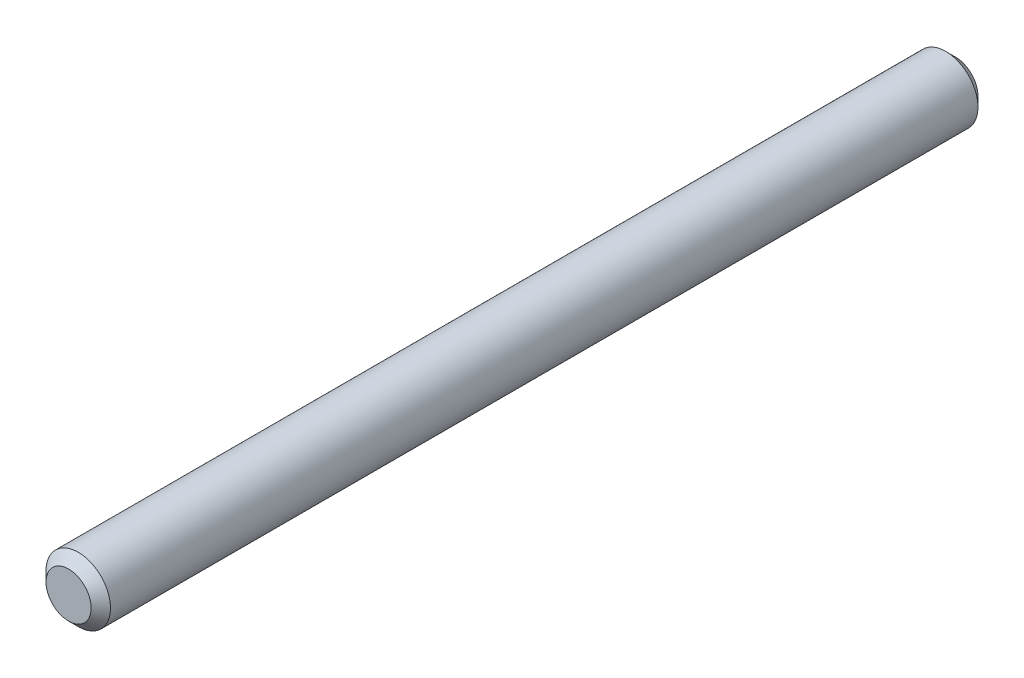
from build123d import *


with BuildPart() as part:
    # Sketch1 → Revolve1 (revolve)
    with BuildSketch(Plane.XZ, mode=Mode.PRIVATE) as revolve1_sk:
        Polygon((0.699985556, 13.75), (0, 13.75), (0, -13.75), (0.699985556, -13.75), (1, -13.449979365), (1, 13.449979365), align=None)
    revolve(revolve1_sk.sketch.rotate(Axis((0, 0, 13.75), (0, 0, -1)), 180), axis=Axis((0, 0, 13.75), (0, 0, -1)))


solid = part.part
